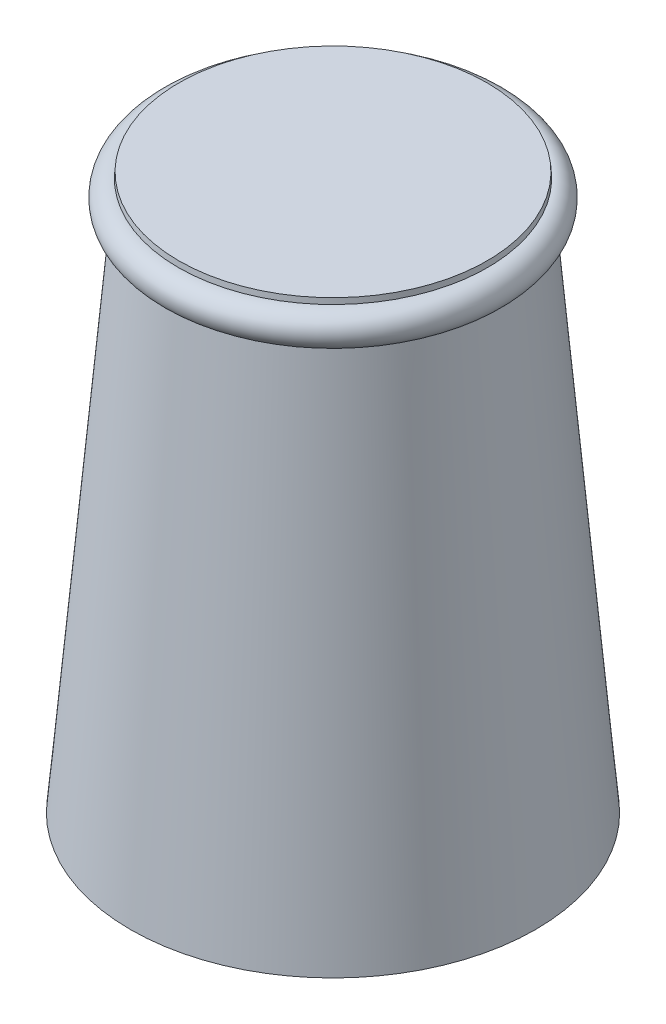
ISO-10303-21;
HEADER;
FILE_DESCRIPTION(('STEP AP214'),'2;1');
FILE_NAME('part.step','',(''),(''),'','','');
FILE_SCHEMA(('AUTOMOTIVE_DESIGN { 1 0 10303 214 1 1 1 1 }'));
ENDSEC;
DATA;
#1=APPLICATION_CONTEXT('core data for automotive mechanical design processes');
#2=APPLICATION_PROTOCOL_DEFINITION('international standard','automotive_design',2000,#1);
#3=PRODUCT_CONTEXT('',#1,'mechanical');
#4=PRODUCT('Part','Part','',(#3));
#5=PRODUCT_RELATED_PRODUCT_CATEGORY('part','',(#4));
#6=PRODUCT_DEFINITION_FORMATION('','',#4);
#7=PRODUCT_DEFINITION_CONTEXT('part definition',#1,'design');
#8=PRODUCT_DEFINITION('design','',#6,#7);
#9=PRODUCT_DEFINITION_SHAPE('','',#8);
#10=(LENGTH_UNIT() NAMED_UNIT(*) SI_UNIT(.MILLI.,.METRE.));
#11=(NAMED_UNIT(*) PLANE_ANGLE_UNIT() SI_UNIT($,.RADIAN.));
#12=(NAMED_UNIT(*) SI_UNIT($,.STERADIAN.) SOLID_ANGLE_UNIT());
#13=UNCERTAINTY_MEASURE_WITH_UNIT(LENGTH_MEASURE(1.E-05),#10,'distance_accuracy_value','');
#14=(GEOMETRIC_REPRESENTATION_CONTEXT(3) GLOBAL_UNCERTAINTY_ASSIGNED_CONTEXT((#13)) GLOBAL_UNIT_ASSIGNED_CONTEXT((#10,
#11,#12)) REPRESENTATION_CONTEXT('',''));
#15=CARTESIAN_POINT('',(0.,0.,0.));
#16=DIRECTION('',(0.,0.,1.));
#17=DIRECTION('',(1.,0.,0.));
#18=AXIS2_PLACEMENT_3D('',#15,#16,#17);
#19=CARTESIAN_POINT('',(0.,0.,0.));
#20=DIRECTION('',(0.,-1.,0.));
#21=DIRECTION('',(0.,0.,1.));
#22=AXIS2_PLACEMENT_3D('',#19,#20,#21);
#23=CONICAL_SURFACE('',#22,18.2650298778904,0.0872664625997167);
#24=CARTESIAN_POINT('',(0.,49.4942920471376,0.));
#25=DIRECTION('',(0.,-1.,0.));
#26=DIRECTION('',(0.,0.,-1.));
#27=AXIS2_PLACEMENT_3D('',#24,#25,#26);
#28=CIRCLE('',#27,13.9348404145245);
#29=CARTESIAN_POINT('',(0.,49.4942920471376,-13.9348404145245));
#30=VERTEX_POINT('',#29);
#31=EDGE_CURVE('E44',#30,#30,#28,.T.);
#32=ORIENTED_EDGE('',*,*,#31,.F.);
#33=EDGE_LOOP('',(#32));
#34=FACE_BOUND('',#33,.T.);
#35=CARTESIAN_POINT('',(0.,50.,0.));
#36=DIRECTION('',(0.,1.,0.));
#37=DIRECTION('',(0.,0.,1.));
#38=AXIS2_PLACEMENT_3D('',#35,#36,#37);
#39=CIRCLE('',#38,13.8905967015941);
#40=CARTESIAN_POINT('',(0.,50.,13.8905967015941));
#41=VERTEX_POINT('',#40);
#42=EDGE_CURVE('E10',#41,#41,#39,.T.);
#43=ORIENTED_EDGE('',*,*,#42,.F.);
#44=EDGE_LOOP('',(#43));
#45=FACE_BOUND('',#44,.T.);
#46=ADVANCED_FACE('F33',(#34,#45),#23,.T.);
#47=CARTESIAN_POINT('',(0.,50.,0.));
#48=DIRECTION('',(0.,1.,0.));
#49=DIRECTION('',(0.,0.,1.));
#50=AXIS2_PLACEMENT_3D('',#47,#48,#49);
#51=PLANE('',#50);
#52=ORIENTED_EDGE('',*,*,#42,.T.);
#53=EDGE_LOOP('',(#52));
#54=FACE_BOUND('',#53,.T.);
#55=ADVANCED_FACE('F58',(#54),#51,.T.);
#56=CARTESIAN_POINT('',(0.,48.,0.));
#57=DIRECTION('',(0.,-1.,0.));
#58=DIRECTION('',(0.,0.,-1.));
#59=AXIS2_PLACEMENT_3D('',#56,#57,#58);
#60=TOROIDAL_SURFACE('',#59,14.065574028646,1.5);
#61=ORIENTED_EDGE('',*,*,#31,.T.);
#62=EDGE_LOOP('',(#61));
#63=FACE_BOUND('',#62,.T.);
#64=CARTESIAN_POINT('',(0.,46.5057079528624,0.));
#65=DIRECTION('',(0.,-1.,0.));
#66=DIRECTION('',(0.,0.,-1.));
#67=AXIS2_PLACEMENT_3D('',#64,#65,#66);
#68=CIRCLE('',#67,14.1963076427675);
#69=CARTESIAN_POINT('',(0.,46.5057079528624,-14.1963076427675));
#70=VERTEX_POINT('',#69);
#71=EDGE_CURVE('E48',#70,#70,#68,.T.);
#72=ORIENTED_EDGE('',*,*,#71,.F.);
#73=EDGE_LOOP('',(#72));
#74=FACE_BOUND('',#73,.T.);
#75=ADVANCED_FACE('F55',(#63,#74),#60,.T.);
#76=CARTESIAN_POINT('',(0.,0.,0.));
#77=DIRECTION('',(0.,1.,0.));
#78=DIRECTION('',(0.,0.,1.));
#79=AXIS2_PLACEMENT_3D('',#76,#77,#78);
#80=PLANE('',#79);
#81=CARTESIAN_POINT('',(0.,0.,0.));
#82=DIRECTION('',(0.,1.,0.));
#83=DIRECTION('',(0.,0.,1.));
#84=AXIS2_PLACEMENT_3D('',#81,#82,#83);
#85=CIRCLE('',#84,18.2650298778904);
#86=CARTESIAN_POINT('',(0.,0.,18.2650298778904));
#87=VERTEX_POINT('',#86);
#88=EDGE_CURVE('E40',#87,#87,#85,.T.);
#89=ORIENTED_EDGE('',*,*,#88,.F.);
#90=EDGE_LOOP('',(#89));
#91=FACE_BOUND('',#90,.T.);
#92=ADVANCED_FACE('F57',(#91),#80,.F.);
#93=ORIENTED_EDGE('',*,*,#71,.T.);
#94=EDGE_LOOP('',(#93));
#95=FACE_BOUND('',#94,.T.);
#96=ORIENTED_EDGE('',*,*,#88,.T.);
#97=EDGE_LOOP('',(#96));
#98=FACE_BOUND('',#97,.T.);
#99=ADVANCED_FACE('F35',(#95,#98),#23,.T.);
#100=CLOSED_SHELL('',(#46,#55,#75,#92,#99));
#101=MANIFOLD_SOLID_BREP('B2',#100);
#102=ADVANCED_BREP_SHAPE_REPRESENTATION('',(#18,#101),#14);
#103=SHAPE_DEFINITION_REPRESENTATION(#9,#102);
ENDSEC;
END-ISO-10303-21;
